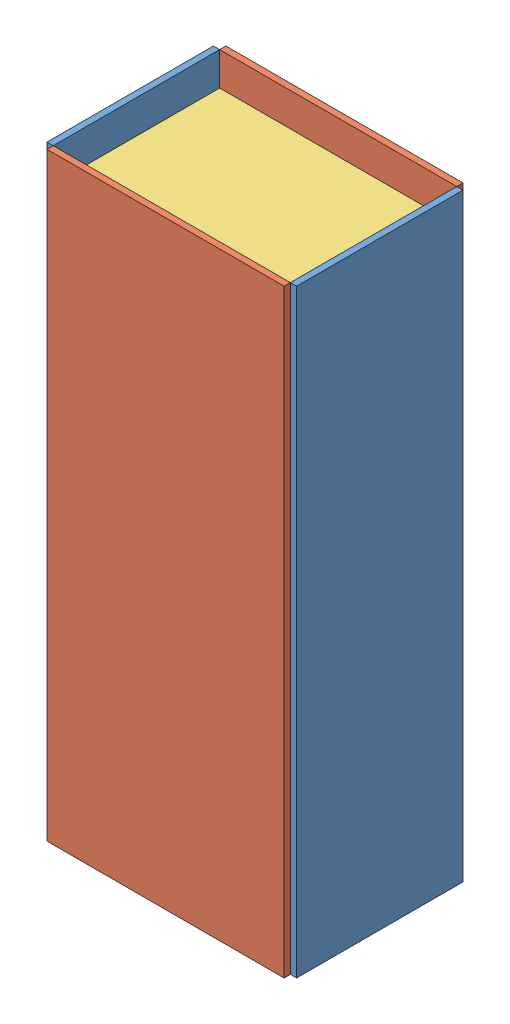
SolidWorks assembly 18 inch Building.SLDASM, configuration Default (file format 9000). Lengths in mm.
Overall size (190.5 457.2 136.53).
6 component instances, 3 part files, 22 mates.
Components (placement in the parent):
- 5 in x 18 in Corrugated Plastic-1: 5 in x 18 in Corrugated Plastic.SLDPRT [Default] at (166.6812 0 219.3784) x (0 0 1) z (0 -1 0) size (127 4.76 457.2)
- 5 in x 18 in Corrugated Plastic-2: 5 in x 18 in Corrugated Plastic.SLDPRT [Default] at (352.4187 0 219.3784) x (0 0 1) z (0 -1 0) size (127 4.76 457.2)
- 7.125 in x 18 in Corrugated Plastic-1: 7.125 in x 18 in Corrugated Plastic.SLDPRT [Default] at (166.6812 457.2 219.3784) x (1 0 0) z (0 1 0) size (180.97 4.76 457.2)
- 7.125 in x 18 in Corrugated Plastic-2: 7.125 in x 18 in Corrugated Plastic.SLDPRT [Default] at (166.6812 457.2 351.1409) x (1 0 0) z (0 1 0) size (180.97 4.76 457.2)
- 5 in x 7.125 in Corrugated Plastic-1: 5 in x 7.125 in Corrugated Plastic.SLDPRT [Default] at (166.6812 427.0375 346.3784) size (180.97 4.76 127)
- 5 in x 7.125 in Corrugated Plastic-2: 5 in x 7.125 in Corrugated Plastic.SLDPRT [Default] at (166.6812 6.35 346.3784) size (180.97 4.76 127)
Mates (geometry in assembly coordinates):
- Coincident2: coincident anti-aligned: plane of ? through (77.2159 0 585.0545) normal (0 -1 0); plane of assembly through (0 0 0) normal (0 1 0)
- Coincident6: coincident anti-aligned: plane of 5 in x 18 in Corrugated Plastic-1 through (161.9187 0 219.3784) normal (0 -1 0); plane of assembly through (0 0 0) normal (0 1 0)
- Coincident11: coincident anti-aligned: plane of 5 in x 18 in Corrugated Plastic-2 through (347.6562 0 219.3784) normal (0 -1 0); plane of assembly through (0 0 0) normal (0 1 0)
- Coincident13: coincident anti-aligned: plane of ? through (77.2159 0 454.0545) normal (0 -1 0); plane of assembly through (0 0 0) normal (0 1 0)
- Coincident15: coincident anti-aligned: plane of 7.125 in x 18 in Corrugated Plastic-1 through (166.6812 0 214.6159) normal (0 -1 0); plane of assembly through (0 0 0) normal (0 1 0)
- Coincident16: coincident anti-aligned: line of 5 in x 18 in Corrugated Plastic-1 through (166.6812 457.2 219.3784) axis (0 -1 0); line of 7.125 in x 18 in Corrugated Plastic-1 through (166.6812 0 219.3784) axis (0 1 0)
- Coincident17: coincident aligned: line of 5 in x 18 in Corrugated Plastic-2 through (347.6562 457.2 219.3784) axis (0 -1 0); line of 7.125 in x 18 in Corrugated Plastic-1 through (347.6562 457.2 219.3784) axis (0 -1 0)
- Coincident18: coincident aligned: line of 5 in x 18 in Corrugated Plastic-1 through (166.6812 0 346.3784) axis (0 1 0); line of 7.125 in x 18 in Corrugated Plastic-2 through (166.6812 0 346.3784) axis (0 1 0)
- Coincident19: coincident anti-aligned: plane of 7.125 in x 18 in Corrugated Plastic-2 through (166.6812 0 346.3784) normal (0 -1 0); plane of assembly through (0 0 0) normal (0 1 0)
- Coincident21: coincident anti-aligned: line of 5 in x 18 in Corrugated Plastic-2 through (347.6562 0 346.3784) axis (0 1 0); line of 7.125 in x 18 in Corrugated Plastic-2 through (347.6562 457.2 346.3784) axis (0 -1 0)
- Coincident22: coincident anti-aligned: plane of 5 in x 18 in Corrugated Plastic-2 through (358.3148 0 235.9202) normal (-1 0 0); plane of ? through (358.3148 463.3684 362.9202) normal (1 0 0)
- Coincident23: coincident anti-aligned: plane of 7.125 in x 18 in Corrugated Plastic-1 through (177.3398 457.2 235.9202) normal (0 0 1); plane of ? through (180.5148 463.3684 235.9202) normal (0 0 -1)
- Coincident24: coincident anti-aligned: plane of 5 in x 18 in Corrugated Plastic-2 through (347.6562 0 219.3784) normal (-1 0 0); plane of 5 in x 7.125 in Corrugated Plastic-1 through (347.6562 431.8 346.3784) normal (1 0 0)
- Coincident25: coincident anti-aligned: plane of 7.125 in x 18 in Corrugated Plastic-1 through (166.6812 457.2 219.3784) normal (0 0 1); plane of 5 in x 7.125 in Corrugated Plastic-1 through (166.6812 431.8 219.3784) normal (0 0 -1)
- Coincident26: coincident anti-aligned: plane of 7.125 in x 18 in Corrugated Plastic-2 through (166.6812 457.2 346.3784) normal (0 0 -1); plane of 5 in x 7.125 in Corrugated Plastic-1 through (166.6812 431.8 346.3784) normal (0 0 1)
- Coincident27: coincident anti-aligned: plane of 5 in x 18 in Corrugated Plastic-1 through (166.6812 0 219.3784) normal (1 0 0); plane of 5 in x 7.125 in Corrugated Plastic-1 through (166.6812 431.8 346.3784) normal (-1 0 0)
- Distance1: distance = 25.4 mm aligned: plane of 5 in x 7.125 in Corrugated Plastic-1 through (166.6812 431.8 346.3784) normal (0 1 0); plane of 5 in x 18 in Corrugated Plastic-1 through (161.9187 457.2 219.3784) normal (0 1 0)
- Coincident28: coincident anti-aligned: plane of 7.125 in x 18 in Corrugated Plastic-2 through (166.6812 457.2 346.3784) normal (0 0 -1); plane of 5 in x 7.125 in Corrugated Plastic-2 through (166.6812 11.1125 346.3784) normal (0 0 1)
- Coincident29: coincident anti-aligned: plane of 5 in x 18 in Corrugated Plastic-2 through (347.6562 0 219.3784) normal (-1 0 0); plane of 5 in x 7.125 in Corrugated Plastic-2 through (347.6562 11.1125 346.3784) normal (1 0 0)
- Distance2: distance = 6.35 mm aligned: plane of 5 in x 7.125 in Corrugated Plastic-2 through (166.6812 6.35 346.3784) normal (0 -1 0); plane of 7.125 in x 18 in Corrugated Plastic-2 through (166.6812 0 346.3784) normal (0 -1 0)
- Coincident31: coincident anti-aligned: plane of 5 in x 18 in Corrugated Plastic-1 through (166.6812 0 219.3784) normal (1 0 0); plane of 5 in x 7.125 in Corrugated Plastic-2 through (166.6812 11.1125 346.3784) normal (-1 0 0)
- Coincident32: coincident anti-aligned: plane of 7.125 in x 18 in Corrugated Plastic-1 through (166.6812 457.2 219.3784) normal (0 0 1); plane of 5 in x 7.125 in Corrugated Plastic-2 through (166.6812 11.1125 219.3784) normal (0 0 -1)
